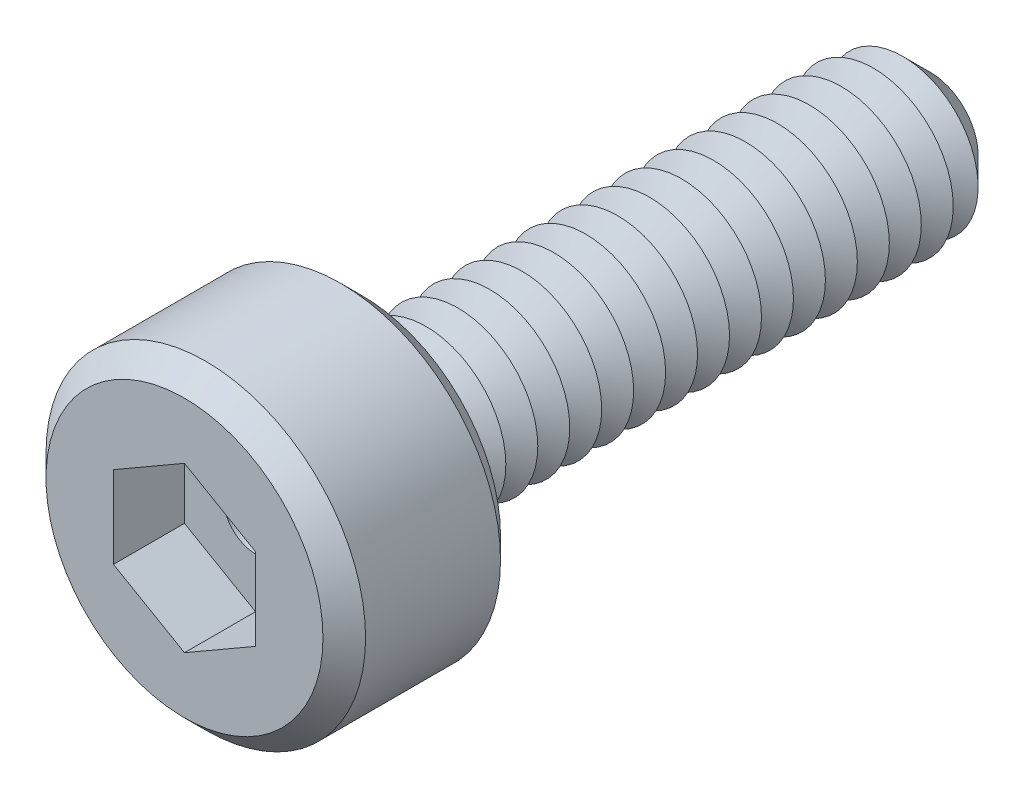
ISO-10303-21;
HEADER;
FILE_DESCRIPTION(('STEP AP214'),'2;1');
FILE_NAME('part.step','',(''),(''),'','','');
FILE_SCHEMA(('AUTOMOTIVE_DESIGN { 1 0 10303 214 1 1 1 1 }'));
ENDSEC;
DATA;
#1=APPLICATION_CONTEXT('core data for automotive mechanical design processes');
#2=APPLICATION_PROTOCOL_DEFINITION('international standard','automotive_design',2000,#1);
#3=PRODUCT_CONTEXT('',#1,'mechanical');
#4=PRODUCT('Part','Part','',(#3));
#5=PRODUCT_RELATED_PRODUCT_CATEGORY('part','',(#4));
#6=PRODUCT_DEFINITION_FORMATION('','',#4);
#7=PRODUCT_DEFINITION_CONTEXT('part definition',#1,'design');
#8=PRODUCT_DEFINITION('design','',#6,#7);
#9=PRODUCT_DEFINITION_SHAPE('','',#8);
#10=(LENGTH_UNIT() NAMED_UNIT(*) SI_UNIT(.MILLI.,.METRE.));
#11=(NAMED_UNIT(*) PLANE_ANGLE_UNIT() SI_UNIT($,.RADIAN.));
#12=(NAMED_UNIT(*) SI_UNIT($,.STERADIAN.) SOLID_ANGLE_UNIT());
#13=UNCERTAINTY_MEASURE_WITH_UNIT(LENGTH_MEASURE(1.E-05),#10,'distance_accuracy_value','');
#14=(GEOMETRIC_REPRESENTATION_CONTEXT(3) GLOBAL_UNCERTAINTY_ASSIGNED_CONTEXT((#13)) GLOBAL_UNIT_ASSIGNED_CONTEXT((#10,
#11,#12)) REPRESENTATION_CONTEXT('',''));
#15=CARTESIAN_POINT('',(0.,0.,0.));
#16=DIRECTION('',(0.,0.,1.));
#17=DIRECTION('',(1.,0.,0.));
#18=AXIS2_PLACEMENT_3D('',#15,#16,#17);
#19=CARTESIAN_POINT('',(0.,0.,2.5));
#20=DIRECTION('',(0.,0.,-1.));
#21=DIRECTION('',(-1.,0.,0.));
#22=AXIS2_PLACEMENT_3D('',#19,#20,#21);
#23=CYLINDRICAL_SURFACE('',#22,2.25);
#24=CARTESIAN_POINT('',(0.,0.,0.300000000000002));
#25=DIRECTION('',(0.,0.,1.));
#26=DIRECTION('',(1.,0.,0.));
#27=AXIS2_PLACEMENT_3D('',#24,#25,#26);
#28=CIRCLE('',#27,2.25);
#29=CARTESIAN_POINT('',(2.25,0.,0.300000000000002));
#30=VERTEX_POINT('',#29);
#31=EDGE_CURVE('E312',#30,#30,#28,.T.);
#32=ORIENTED_EDGE('',*,*,#31,.T.);
#33=EDGE_LOOP('',(#32));
#34=FACE_BOUND('',#33,.T.);
#35=CARTESIAN_POINT('',(0.,0.,2.2));
#36=DIRECTION('',(0.,0.,1.));
#37=DIRECTION('',(1.,0.,0.));
#38=AXIS2_PLACEMENT_3D('',#35,#36,#37);
#39=CIRCLE('',#38,2.25);
#40=CARTESIAN_POINT('',(2.25,0.,2.2));
#41=VERTEX_POINT('',#40);
#42=EDGE_CURVE('E305',#41,#41,#39,.F.);
#43=ORIENTED_EDGE('',*,*,#42,.T.);
#44=EDGE_LOOP('',(#43));
#45=FACE_BOUND('',#44,.T.);
#46=ADVANCED_FACE('F39',(#34,#45),#23,.T.);
#47=CARTESIAN_POINT('',(0.,0.,2.5));
#48=DIRECTION('',(0.,0.,1.));
#49=DIRECTION('',(1.,0.,0.));
#50=AXIS2_PLACEMENT_3D('',#47,#48,#49);
#51=PLANE('',#50);
#52=CARTESIAN_POINT('',(0.,0.,2.5));
#53=DIRECTION('',(0.,0.,1.));
#54=DIRECTION('',(1.,0.,0.));
#55=AXIS2_PLACEMENT_3D('',#52,#53,#54);
#56=CIRCLE('',#55,1.95);
#57=CARTESIAN_POINT('',(1.95,0.,2.5));
#58=VERTEX_POINT('',#57);
#59=EDGE_CURVE('E11',#58,#58,#56,.T.);
#60=ORIENTED_EDGE('',*,*,#59,.T.);
#61=EDGE_LOOP('',(#60));
#62=FACE_BOUND('',#61,.T.);
#63=DIRECTION('',(-0.866025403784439,0.5,0.));
#64=VECTOR('',#63,1.);
#65=CARTESIAN_POINT('',(0.999999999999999,0.577350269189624,2.5));
#66=LINE('',#65,#64);
#67=CARTESIAN_POINT('',(0.999999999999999,0.577350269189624,2.5));
#68=VERTEX_POINT('',#67);
#69=CARTESIAN_POINT('',(0.,1.15470053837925,2.5));
#70=VERTEX_POINT('',#69);
#71=EDGE_CURVE('E55',#68,#70,#66,.T.);
#72=ORIENTED_EDGE('',*,*,#71,.F.);
#73=DIRECTION('',(0.,1.,0.));
#74=VECTOR('',#73,1.);
#75=CARTESIAN_POINT('',(1.,-0.577350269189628,2.5));
#76=LINE('',#75,#74);
#77=CARTESIAN_POINT('',(1.,-0.577350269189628,2.5));
#78=VERTEX_POINT('',#77);
#79=EDGE_CURVE('E151',#78,#68,#76,.T.);
#80=ORIENTED_EDGE('',*,*,#79,.F.);
#81=DIRECTION('',(0.866025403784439,0.5,0.));
#82=VECTOR('',#81,1.);
#83=CARTESIAN_POINT('',(0.,-1.15470053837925,2.5));
#84=LINE('',#83,#82);
#85=CARTESIAN_POINT('',(0.,-1.15470053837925,2.5));
#86=VERTEX_POINT('',#85);
#87=EDGE_CURVE('E148',#86,#78,#84,.T.);
#88=ORIENTED_EDGE('',*,*,#87,.F.);
#89=DIRECTION('',(0.866025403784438,-0.5,0.));
#90=VECTOR('',#89,1.);
#91=CARTESIAN_POINT('',(-1.,-0.577350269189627,2.5));
#92=LINE('',#91,#90);
#93=CARTESIAN_POINT('',(-1.,-0.577350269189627,2.5));
#94=VERTEX_POINT('',#93);
#95=EDGE_CURVE('E103',#94,#86,#92,.T.);
#96=ORIENTED_EDGE('',*,*,#95,.F.);
#97=DIRECTION('',(0.,-1.,0.));
#98=VECTOR('',#97,1.);
#99=CARTESIAN_POINT('',(-1.,0.577350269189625,2.5));
#100=LINE('',#99,#98);
#101=CARTESIAN_POINT('',(-1.,0.577350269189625,2.5));
#102=VERTEX_POINT('',#101);
#103=EDGE_CURVE('E142',#102,#94,#100,.T.);
#104=ORIENTED_EDGE('',*,*,#103,.F.);
#105=DIRECTION('',(-0.866025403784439,-0.5,0.));
#106=VECTOR('',#105,1.);
#107=CARTESIAN_POINT('',(0.,1.15470053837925,2.5));
#108=LINE('',#107,#106);
#109=EDGE_CURVE('E137',#70,#102,#108,.T.);
#110=ORIENTED_EDGE('',*,*,#109,.F.);
#111=EDGE_LOOP('',(#72,#80,#88,#96,#104,#110));
#112=FACE_BOUND('',#111,.T.);
#113=ADVANCED_FACE('F330',(#62,#112),#51,.T.);
#114=CARTESIAN_POINT('',(0.,0.,0.));
#115=DIRECTION('',(0.,0.,1.));
#116=DIRECTION('',(1.,0.,0.));
#117=AXIS2_PLACEMENT_3D('',#114,#115,#116);
#118=PLANE('',#117);
#119=CARTESIAN_POINT('',(0.,0.,0.));
#120=DIRECTION('',(0.,0.,1.));
#121=DIRECTION('',(1.,0.,0.));
#122=AXIS2_PLACEMENT_3D('',#119,#120,#121);
#123=CIRCLE('',#122,1.95);
#124=CARTESIAN_POINT('',(1.95,0.,0.));
#125=VERTEX_POINT('',#124);
#126=EDGE_CURVE('E48',#125,#125,#123,.F.);
#127=ORIENTED_EDGE('',*,*,#126,.T.);
#128=EDGE_LOOP('',(#127));
#129=FACE_BOUND('',#128,.T.);
#130=CARTESIAN_POINT('',(0.,0.,0.));
#131=DIRECTION('',(0.,0.,1.));
#132=DIRECTION('',(1.,0.,0.));
#133=AXIS2_PLACEMENT_3D('',#130,#131,#132);
#134=CIRCLE('',#133,1.125);
#135=CARTESIAN_POINT('',(1.125,0.,0.));
#136=VERTEX_POINT('',#135);
#137=EDGE_CURVE('E297',#136,#136,#134,.T.);
#138=ORIENTED_EDGE('',*,*,#137,.T.);
#139=EDGE_LOOP('',(#138));
#140=FACE_BOUND('',#139,.T.);
#141=ADVANCED_FACE('F319',(#129,#140),#118,.F.);
#142=CARTESIAN_POINT('',(0.,0.,0.));
#143=DIRECTION('',(0.,0.,1.));
#144=DIRECTION('',(1.,0.,0.));
#145=AXIS2_PLACEMENT_3D('',#142,#143,#144);
#146=CONICAL_SURFACE('',#145,1.125,1.0471975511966);
#147=CARTESIAN_POINT('',(0.,0.,-0.225));
#148=DIRECTION('',(0.,0.,1.));
#149=DIRECTION('',(1.,0.,0.));
#150=AXIS2_PLACEMENT_3D('',#147,#148,#149);
#151=CIRCLE('',#150,0.735288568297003);
#152=CARTESIAN_POINT('',(0.735288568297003,0.,-0.225));
#153=VERTEX_POINT('',#152);
#154=EDGE_CURVE('E293',#153,#153,#151,.T.);
#155=ORIENTED_EDGE('',*,*,#154,.T.);
#156=EDGE_LOOP('',(#155));
#157=FACE_BOUND('',#156,.T.);
#158=ORIENTED_EDGE('',*,*,#137,.F.);
#159=EDGE_LOOP('',(#158));
#160=FACE_BOUND('',#159,.T.);
#161=ADVANCED_FACE('F516',(#157,#160),#146,.T.);
#162=CARTESIAN_POINT('',(0.,0.,-0.225));
#163=DIRECTION('',(0.,0.,-1.));
#164=DIRECTION('',(-1.,0.,0.));
#165=AXIS2_PLACEMENT_3D('',#162,#163,#164);
#166=CONICAL_SURFACE('',#165,0.735288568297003,1.0471975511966);
#167=CARTESIAN_POINT('',(0.,0.,-0.45));
#168=DIRECTION('',(0.,0.,1.));
#169=DIRECTION('',(1.,0.,0.));
#170=AXIS2_PLACEMENT_3D('',#167,#168,#169);
#171=CIRCLE('',#170,1.125);
#172=CARTESIAN_POINT('',(1.125,0.,-0.45));
#173=VERTEX_POINT('',#172);
#174=EDGE_CURVE('E289',#173,#173,#171,.T.);
#175=ORIENTED_EDGE('',*,*,#174,.T.);
#176=EDGE_LOOP('',(#175));
#177=FACE_BOUND('',#176,.T.);
#178=ORIENTED_EDGE('',*,*,#154,.F.);
#179=EDGE_LOOP('',(#178));
#180=FACE_BOUND('',#179,.T.);
#181=ADVANCED_FACE('F512',(#177,#180),#166,.T.);
#182=CARTESIAN_POINT('',(0.,0.,-0.45));
#183=DIRECTION('',(0.,0.,1.));
#184=DIRECTION('',(1.,0.,0.));
#185=AXIS2_PLACEMENT_3D('',#182,#183,#184);
#186=CONICAL_SURFACE('',#185,1.125,1.0471975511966);
#187=CARTESIAN_POINT('',(0.,0.,-0.675));
#188=DIRECTION('',(0.,0.,1.));
#189=DIRECTION('',(1.,0.,0.));
#190=AXIS2_PLACEMENT_3D('',#187,#188,#189);
#191=CIRCLE('',#190,0.735288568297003);
#192=CARTESIAN_POINT('',(0.735288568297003,0.,-0.675));
#193=VERTEX_POINT('',#192);
#194=EDGE_CURVE('E285',#193,#193,#191,.T.);
#195=ORIENTED_EDGE('',*,*,#194,.T.);
#196=EDGE_LOOP('',(#195));
#197=FACE_BOUND('',#196,.T.);
#198=ORIENTED_EDGE('',*,*,#174,.F.);
#199=EDGE_LOOP('',(#198));
#200=FACE_BOUND('',#199,.T.);
#201=ADVANCED_FACE('F508',(#197,#200),#186,.T.);
#202=CARTESIAN_POINT('',(0.,0.,-0.675));
#203=DIRECTION('',(0.,0.,-1.));
#204=DIRECTION('',(-1.,0.,0.));
#205=AXIS2_PLACEMENT_3D('',#202,#203,#204);
#206=CONICAL_SURFACE('',#205,0.735288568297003,1.0471975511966);
#207=CARTESIAN_POINT('',(0.,0.,-0.9));
#208=DIRECTION('',(0.,0.,1.));
#209=DIRECTION('',(1.,0.,0.));
#210=AXIS2_PLACEMENT_3D('',#207,#208,#209);
#211=CIRCLE('',#210,1.125);
#212=CARTESIAN_POINT('',(1.125,0.,-0.9));
#213=VERTEX_POINT('',#212);
#214=EDGE_CURVE('E281',#213,#213,#211,.T.);
#215=ORIENTED_EDGE('',*,*,#214,.T.);
#216=EDGE_LOOP('',(#215));
#217=FACE_BOUND('',#216,.T.);
#218=ORIENTED_EDGE('',*,*,#194,.F.);
#219=EDGE_LOOP('',(#218));
#220=FACE_BOUND('',#219,.T.);
#221=ADVANCED_FACE('F504',(#217,#220),#206,.T.);
#222=CARTESIAN_POINT('',(0.,0.,-0.9));
#223=DIRECTION('',(0.,0.,1.));
#224=DIRECTION('',(1.,0.,0.));
#225=AXIS2_PLACEMENT_3D('',#222,#223,#224);
#226=CONICAL_SURFACE('',#225,1.125,1.0471975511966);
#227=CARTESIAN_POINT('',(0.,0.,-1.125));
#228=DIRECTION('',(0.,0.,1.));
#229=DIRECTION('',(1.,0.,0.));
#230=AXIS2_PLACEMENT_3D('',#227,#228,#229);
#231=CIRCLE('',#230,0.735288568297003);
#232=CARTESIAN_POINT('',(0.735288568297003,0.,-1.125));
#233=VERTEX_POINT('',#232);
#234=EDGE_CURVE('E277',#233,#233,#231,.T.);
#235=ORIENTED_EDGE('',*,*,#234,.T.);
#236=EDGE_LOOP('',(#235));
#237=FACE_BOUND('',#236,.T.);
#238=ORIENTED_EDGE('',*,*,#214,.F.);
#239=EDGE_LOOP('',(#238));
#240=FACE_BOUND('',#239,.T.);
#241=ADVANCED_FACE('F500',(#237,#240),#226,.T.);
#242=CARTESIAN_POINT('',(0.,0.,-1.125));
#243=DIRECTION('',(0.,0.,-1.));
#244=DIRECTION('',(-1.,0.,0.));
#245=AXIS2_PLACEMENT_3D('',#242,#243,#244);
#246=CONICAL_SURFACE('',#245,0.735288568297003,1.0471975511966);
#247=CARTESIAN_POINT('',(0.,0.,-1.35));
#248=DIRECTION('',(0.,0.,1.));
#249=DIRECTION('',(1.,0.,0.));
#250=AXIS2_PLACEMENT_3D('',#247,#248,#249);
#251=CIRCLE('',#250,1.125);
#252=CARTESIAN_POINT('',(1.125,0.,-1.35));
#253=VERTEX_POINT('',#252);
#254=EDGE_CURVE('E273',#253,#253,#251,.T.);
#255=ORIENTED_EDGE('',*,*,#254,.T.);
#256=EDGE_LOOP('',(#255));
#257=FACE_BOUND('',#256,.T.);
#258=ORIENTED_EDGE('',*,*,#234,.F.);
#259=EDGE_LOOP('',(#258));
#260=FACE_BOUND('',#259,.T.);
#261=ADVANCED_FACE('F496',(#257,#260),#246,.T.);
#262=CARTESIAN_POINT('',(0.,0.,-1.35));
#263=DIRECTION('',(0.,0.,1.));
#264=DIRECTION('',(1.,0.,0.));
#265=AXIS2_PLACEMENT_3D('',#262,#263,#264);
#266=CONICAL_SURFACE('',#265,1.125,1.0471975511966);
#267=CARTESIAN_POINT('',(0.,0.,-1.575));
#268=DIRECTION('',(0.,0.,1.));
#269=DIRECTION('',(1.,0.,0.));
#270=AXIS2_PLACEMENT_3D('',#267,#268,#269);
#271=CIRCLE('',#270,0.735288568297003);
#272=CARTESIAN_POINT('',(0.735288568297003,0.,-1.575));
#273=VERTEX_POINT('',#272);
#274=EDGE_CURVE('E269',#273,#273,#271,.T.);
#275=ORIENTED_EDGE('',*,*,#274,.T.);
#276=EDGE_LOOP('',(#275));
#277=FACE_BOUND('',#276,.T.);
#278=ORIENTED_EDGE('',*,*,#254,.F.);
#279=EDGE_LOOP('',(#278));
#280=FACE_BOUND('',#279,.T.);
#281=ADVANCED_FACE('F492',(#277,#280),#266,.T.);
#282=CARTESIAN_POINT('',(0.,0.,-1.575));
#283=DIRECTION('',(0.,0.,-1.));
#284=DIRECTION('',(-1.,0.,0.));
#285=AXIS2_PLACEMENT_3D('',#282,#283,#284);
#286=CONICAL_SURFACE('',#285,0.735288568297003,1.0471975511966);
#287=CARTESIAN_POINT('',(0.,0.,-1.8));
#288=DIRECTION('',(0.,0.,1.));
#289=DIRECTION('',(1.,0.,0.));
#290=AXIS2_PLACEMENT_3D('',#287,#288,#289);
#291=CIRCLE('',#290,1.125);
#292=CARTESIAN_POINT('',(1.125,0.,-1.8));
#293=VERTEX_POINT('',#292);
#294=EDGE_CURVE('E265',#293,#293,#291,.T.);
#295=ORIENTED_EDGE('',*,*,#294,.T.);
#296=EDGE_LOOP('',(#295));
#297=FACE_BOUND('',#296,.T.);
#298=ORIENTED_EDGE('',*,*,#274,.F.);
#299=EDGE_LOOP('',(#298));
#300=FACE_BOUND('',#299,.T.);
#301=ADVANCED_FACE('F488',(#297,#300),#286,.T.);
#302=CARTESIAN_POINT('',(0.,0.,-1.8));
#303=DIRECTION('',(0.,0.,1.));
#304=DIRECTION('',(1.,0.,0.));
#305=AXIS2_PLACEMENT_3D('',#302,#303,#304);
#306=CONICAL_SURFACE('',#305,1.125,1.0471975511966);
#307=CARTESIAN_POINT('',(0.,0.,-2.025));
#308=DIRECTION('',(0.,0.,1.));
#309=DIRECTION('',(1.,0.,0.));
#310=AXIS2_PLACEMENT_3D('',#307,#308,#309);
#311=CIRCLE('',#310,0.735288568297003);
#312=CARTESIAN_POINT('',(0.735288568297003,0.,-2.025));
#313=VERTEX_POINT('',#312);
#314=EDGE_CURVE('E261',#313,#313,#311,.T.);
#315=ORIENTED_EDGE('',*,*,#314,.T.);
#316=EDGE_LOOP('',(#315));
#317=FACE_BOUND('',#316,.T.);
#318=ORIENTED_EDGE('',*,*,#294,.F.);
#319=EDGE_LOOP('',(#318));
#320=FACE_BOUND('',#319,.T.);
#321=ADVANCED_FACE('F484',(#317,#320),#306,.T.);
#322=CARTESIAN_POINT('',(0.,0.,-2.025));
#323=DIRECTION('',(0.,0.,-1.));
#324=DIRECTION('',(-1.,0.,0.));
#325=AXIS2_PLACEMENT_3D('',#322,#323,#324);
#326=CONICAL_SURFACE('',#325,0.735288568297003,1.0471975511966);
#327=CARTESIAN_POINT('',(0.,0.,-2.25));
#328=DIRECTION('',(0.,0.,1.));
#329=DIRECTION('',(1.,0.,0.));
#330=AXIS2_PLACEMENT_3D('',#327,#328,#329);
#331=CIRCLE('',#330,1.125);
#332=CARTESIAN_POINT('',(1.125,0.,-2.25));
#333=VERTEX_POINT('',#332);
#334=EDGE_CURVE('E257',#333,#333,#331,.T.);
#335=ORIENTED_EDGE('',*,*,#334,.T.);
#336=EDGE_LOOP('',(#335));
#337=FACE_BOUND('',#336,.T.);
#338=ORIENTED_EDGE('',*,*,#314,.F.);
#339=EDGE_LOOP('',(#338));
#340=FACE_BOUND('',#339,.T.);
#341=ADVANCED_FACE('F480',(#337,#340),#326,.T.);
#342=CARTESIAN_POINT('',(0.,0.,-2.25));
#343=DIRECTION('',(0.,0.,1.));
#344=DIRECTION('',(1.,0.,0.));
#345=AXIS2_PLACEMENT_3D('',#342,#343,#344);
#346=CONICAL_SURFACE('',#345,1.125,1.0471975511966);
#347=CARTESIAN_POINT('',(0.,0.,-2.475));
#348=DIRECTION('',(0.,0.,1.));
#349=DIRECTION('',(1.,0.,0.));
#350=AXIS2_PLACEMENT_3D('',#347,#348,#349);
#351=CIRCLE('',#350,0.735288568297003);
#352=CARTESIAN_POINT('',(0.735288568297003,0.,-2.475));
#353=VERTEX_POINT('',#352);
#354=EDGE_CURVE('E253',#353,#353,#351,.T.);
#355=ORIENTED_EDGE('',*,*,#354,.T.);
#356=EDGE_LOOP('',(#355));
#357=FACE_BOUND('',#356,.T.);
#358=ORIENTED_EDGE('',*,*,#334,.F.);
#359=EDGE_LOOP('',(#358));
#360=FACE_BOUND('',#359,.T.);
#361=ADVANCED_FACE('F476',(#357,#360),#346,.T.);
#362=CARTESIAN_POINT('',(0.,0.,-2.475));
#363=DIRECTION('',(0.,0.,-1.));
#364=DIRECTION('',(-1.,0.,0.));
#365=AXIS2_PLACEMENT_3D('',#362,#363,#364);
#366=CONICAL_SURFACE('',#365,0.735288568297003,1.0471975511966);
#367=CARTESIAN_POINT('',(0.,0.,-2.7));
#368=DIRECTION('',(0.,0.,1.));
#369=DIRECTION('',(1.,0.,0.));
#370=AXIS2_PLACEMENT_3D('',#367,#368,#369);
#371=CIRCLE('',#370,1.125);
#372=CARTESIAN_POINT('',(1.125,0.,-2.7));
#373=VERTEX_POINT('',#372);
#374=EDGE_CURVE('E250',#373,#373,#371,.T.);
#375=ORIENTED_EDGE('',*,*,#374,.T.);
#376=EDGE_LOOP('',(#375));
#377=FACE_BOUND('',#376,.T.);
#378=ORIENTED_EDGE('',*,*,#354,.F.);
#379=EDGE_LOOP('',(#378));
#380=FACE_BOUND('',#379,.T.);
#381=ADVANCED_FACE('F472',(#377,#380),#366,.T.);
#382=CARTESIAN_POINT('',(0.,0.,-2.7));
#383=DIRECTION('',(0.,0.,1.));
#384=DIRECTION('',(1.,0.,0.));
#385=AXIS2_PLACEMENT_3D('',#382,#383,#384);
#386=CONICAL_SURFACE('',#385,1.125,1.0471975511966);
#387=CARTESIAN_POINT('',(0.,0.,-2.925));
#388=DIRECTION('',(0.,0.,1.));
#389=DIRECTION('',(1.,0.,0.));
#390=AXIS2_PLACEMENT_3D('',#387,#388,#389);
#391=CIRCLE('',#390,0.735288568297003);
#392=CARTESIAN_POINT('',(0.735288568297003,0.,-2.925));
#393=VERTEX_POINT('',#392);
#394=EDGE_CURVE('E246',#393,#393,#391,.T.);
#395=ORIENTED_EDGE('',*,*,#394,.T.);
#396=EDGE_LOOP('',(#395));
#397=FACE_BOUND('',#396,.T.);
#398=ORIENTED_EDGE('',*,*,#374,.F.);
#399=EDGE_LOOP('',(#398));
#400=FACE_BOUND('',#399,.T.);
#401=ADVANCED_FACE('F468',(#397,#400),#386,.T.);
#402=CARTESIAN_POINT('',(0.,0.,-2.925));
#403=DIRECTION('',(0.,0.,-1.));
#404=DIRECTION('',(-1.,0.,0.));
#405=AXIS2_PLACEMENT_3D('',#402,#403,#404);
#406=CONICAL_SURFACE('',#405,0.735288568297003,1.0471975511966);
#407=CARTESIAN_POINT('',(0.,0.,-3.15));
#408=DIRECTION('',(0.,0.,1.));
#409=DIRECTION('',(1.,0.,0.));
#410=AXIS2_PLACEMENT_3D('',#407,#408,#409);
#411=CIRCLE('',#410,1.125);
#412=CARTESIAN_POINT('',(1.125,0.,-3.15));
#413=VERTEX_POINT('',#412);
#414=EDGE_CURVE('E242',#413,#413,#411,.T.);
#415=ORIENTED_EDGE('',*,*,#414,.T.);
#416=EDGE_LOOP('',(#415));
#417=FACE_BOUND('',#416,.T.);
#418=ORIENTED_EDGE('',*,*,#394,.F.);
#419=EDGE_LOOP('',(#418));
#420=FACE_BOUND('',#419,.T.);
#421=ADVANCED_FACE('F464',(#417,#420),#406,.T.);
#422=CARTESIAN_POINT('',(0.,0.,-3.15));
#423=DIRECTION('',(0.,0.,1.));
#424=DIRECTION('',(1.,0.,0.));
#425=AXIS2_PLACEMENT_3D('',#422,#423,#424);
#426=CONICAL_SURFACE('',#425,1.125,1.0471975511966);
#427=CARTESIAN_POINT('',(0.,0.,-3.375));
#428=DIRECTION('',(0.,0.,1.));
#429=DIRECTION('',(1.,0.,0.));
#430=AXIS2_PLACEMENT_3D('',#427,#428,#429);
#431=CIRCLE('',#430,0.735288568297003);
#432=CARTESIAN_POINT('',(0.735288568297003,0.,-3.375));
#433=VERTEX_POINT('',#432);
#434=EDGE_CURVE('E238',#433,#433,#431,.T.);
#435=ORIENTED_EDGE('',*,*,#434,.T.);
#436=EDGE_LOOP('',(#435));
#437=FACE_BOUND('',#436,.T.);
#438=ORIENTED_EDGE('',*,*,#414,.F.);
#439=EDGE_LOOP('',(#438));
#440=FACE_BOUND('',#439,.T.);
#441=ADVANCED_FACE('F460',(#437,#440),#426,.T.);
#442=CARTESIAN_POINT('',(0.,0.,-3.375));
#443=DIRECTION('',(0.,0.,-1.));
#444=DIRECTION('',(-1.,0.,0.));
#445=AXIS2_PLACEMENT_3D('',#442,#443,#444);
#446=CONICAL_SURFACE('',#445,0.735288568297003,1.0471975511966);
#447=CARTESIAN_POINT('',(0.,0.,-3.6));
#448=DIRECTION('',(0.,0.,1.));
#449=DIRECTION('',(1.,0.,0.));
#450=AXIS2_PLACEMENT_3D('',#447,#448,#449);
#451=CIRCLE('',#450,1.125);
#452=CARTESIAN_POINT('',(1.125,0.,-3.6));
#453=VERTEX_POINT('',#452);
#454=EDGE_CURVE('E234',#453,#453,#451,.T.);
#455=ORIENTED_EDGE('',*,*,#454,.T.);
#456=EDGE_LOOP('',(#455));
#457=FACE_BOUND('',#456,.T.);
#458=ORIENTED_EDGE('',*,*,#434,.F.);
#459=EDGE_LOOP('',(#458));
#460=FACE_BOUND('',#459,.T.);
#461=ADVANCED_FACE('F456',(#457,#460),#446,.T.);
#462=CARTESIAN_POINT('',(0.,0.,-3.6));
#463=DIRECTION('',(0.,0.,1.));
#464=DIRECTION('',(1.,0.,0.));
#465=AXIS2_PLACEMENT_3D('',#462,#463,#464);
#466=CONICAL_SURFACE('',#465,1.125,1.0471975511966);
#467=CARTESIAN_POINT('',(0.,0.,-3.825));
#468=DIRECTION('',(0.,0.,1.));
#469=DIRECTION('',(1.,0.,0.));
#470=AXIS2_PLACEMENT_3D('',#467,#468,#469);
#471=CIRCLE('',#470,0.735288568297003);
#472=CARTESIAN_POINT('',(0.735288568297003,0.,-3.825));
#473=VERTEX_POINT('',#472);
#474=EDGE_CURVE('E230',#473,#473,#471,.T.);
#475=ORIENTED_EDGE('',*,*,#474,.T.);
#476=EDGE_LOOP('',(#475));
#477=FACE_BOUND('',#476,.T.);
#478=ORIENTED_EDGE('',*,*,#454,.F.);
#479=EDGE_LOOP('',(#478));
#480=FACE_BOUND('',#479,.T.);
#481=ADVANCED_FACE('F452',(#477,#480),#466,.T.);
#482=CARTESIAN_POINT('',(0.,0.,-3.825));
#483=DIRECTION('',(0.,0.,-1.));
#484=DIRECTION('',(-1.,0.,0.));
#485=AXIS2_PLACEMENT_3D('',#482,#483,#484);
#486=CONICAL_SURFACE('',#485,0.735288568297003,1.0471975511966);
#487=CARTESIAN_POINT('',(0.,0.,-4.05));
#488=DIRECTION('',(0.,0.,1.));
#489=DIRECTION('',(1.,0.,0.));
#490=AXIS2_PLACEMENT_3D('',#487,#488,#489);
#491=CIRCLE('',#490,1.125);
#492=CARTESIAN_POINT('',(1.125,0.,-4.05));
#493=VERTEX_POINT('',#492);
#494=EDGE_CURVE('E226',#493,#493,#491,.T.);
#495=ORIENTED_EDGE('',*,*,#494,.T.);
#496=EDGE_LOOP('',(#495));
#497=FACE_BOUND('',#496,.T.);
#498=ORIENTED_EDGE('',*,*,#474,.F.);
#499=EDGE_LOOP('',(#498));
#500=FACE_BOUND('',#499,.T.);
#501=ADVANCED_FACE('F448',(#497,#500),#486,.T.);
#502=CARTESIAN_POINT('',(0.,0.,-4.05));
#503=DIRECTION('',(0.,0.,1.));
#504=DIRECTION('',(1.,0.,0.));
#505=AXIS2_PLACEMENT_3D('',#502,#503,#504);
#506=CONICAL_SURFACE('',#505,1.125,1.0471975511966);
#507=CARTESIAN_POINT('',(0.,0.,-4.275));
#508=DIRECTION('',(0.,0.,1.));
#509=DIRECTION('',(1.,0.,0.));
#510=AXIS2_PLACEMENT_3D('',#507,#508,#509);
#511=CIRCLE('',#510,0.735288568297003);
#512=CARTESIAN_POINT('',(0.735288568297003,0.,-4.275));
#513=VERTEX_POINT('',#512);
#514=EDGE_CURVE('E222',#513,#513,#511,.T.);
#515=ORIENTED_EDGE('',*,*,#514,.T.);
#516=EDGE_LOOP('',(#515));
#517=FACE_BOUND('',#516,.T.);
#518=ORIENTED_EDGE('',*,*,#494,.F.);
#519=EDGE_LOOP('',(#518));
#520=FACE_BOUND('',#519,.T.);
#521=ADVANCED_FACE('F444',(#517,#520),#506,.T.);
#522=CARTESIAN_POINT('',(0.,0.,-4.275));
#523=DIRECTION('',(0.,0.,-1.));
#524=DIRECTION('',(-1.,0.,0.));
#525=AXIS2_PLACEMENT_3D('',#522,#523,#524);
#526=CONICAL_SURFACE('',#525,0.735288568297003,1.0471975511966);
#527=CARTESIAN_POINT('',(0.,0.,-4.5));
#528=DIRECTION('',(0.,0.,1.));
#529=DIRECTION('',(1.,0.,0.));
#530=AXIS2_PLACEMENT_3D('',#527,#528,#529);
#531=CIRCLE('',#530,1.125);
#532=CARTESIAN_POINT('',(1.125,0.,-4.5));
#533=VERTEX_POINT('',#532);
#534=EDGE_CURVE('E218',#533,#533,#531,.T.);
#535=ORIENTED_EDGE('',*,*,#534,.T.);
#536=EDGE_LOOP('',(#535));
#537=FACE_BOUND('',#536,.T.);
#538=ORIENTED_EDGE('',*,*,#514,.F.);
#539=EDGE_LOOP('',(#538));
#540=FACE_BOUND('',#539,.T.);
#541=ADVANCED_FACE('F440',(#537,#540),#526,.T.);
#542=CARTESIAN_POINT('',(0.,0.,-4.5));
#543=DIRECTION('',(0.,0.,1.));
#544=DIRECTION('',(1.,0.,0.));
#545=AXIS2_PLACEMENT_3D('',#542,#543,#544);
#546=CONICAL_SURFACE('',#545,1.125,1.0471975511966);
#547=CARTESIAN_POINT('',(0.,0.,-4.725));
#548=DIRECTION('',(0.,0.,1.));
#549=DIRECTION('',(1.,0.,0.));
#550=AXIS2_PLACEMENT_3D('',#547,#548,#549);
#551=CIRCLE('',#550,0.735288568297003);
#552=CARTESIAN_POINT('',(0.735288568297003,0.,-4.725));
#553=VERTEX_POINT('',#552);
#554=EDGE_CURVE('E214',#553,#553,#551,.T.);
#555=ORIENTED_EDGE('',*,*,#554,.T.);
#556=EDGE_LOOP('',(#555));
#557=FACE_BOUND('',#556,.T.);
#558=ORIENTED_EDGE('',*,*,#534,.F.);
#559=EDGE_LOOP('',(#558));
#560=FACE_BOUND('',#559,.T.);
#561=ADVANCED_FACE('F436',(#557,#560),#546,.T.);
#562=CARTESIAN_POINT('',(0.,0.,-4.725));
#563=DIRECTION('',(0.,0.,-1.));
#564=DIRECTION('',(-1.,0.,0.));
#565=AXIS2_PLACEMENT_3D('',#562,#563,#564);
#566=CONICAL_SURFACE('',#565,0.735288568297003,1.0471975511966);
#567=CARTESIAN_POINT('',(0.,0.,-4.95));
#568=DIRECTION('',(0.,0.,1.));
#569=DIRECTION('',(1.,0.,0.));
#570=AXIS2_PLACEMENT_3D('',#567,#568,#569);
#571=CIRCLE('',#570,1.125);
#572=CARTESIAN_POINT('',(1.125,0.,-4.95));
#573=VERTEX_POINT('',#572);
#574=EDGE_CURVE('E210',#573,#573,#571,.T.);
#575=ORIENTED_EDGE('',*,*,#574,.T.);
#576=EDGE_LOOP('',(#575));
#577=FACE_BOUND('',#576,.T.);
#578=ORIENTED_EDGE('',*,*,#554,.F.);
#579=EDGE_LOOP('',(#578));
#580=FACE_BOUND('',#579,.T.);
#581=ADVANCED_FACE('F432',(#577,#580),#566,.T.);
#582=CARTESIAN_POINT('',(0.,0.,-4.95));
#583=DIRECTION('',(0.,0.,1.));
#584=DIRECTION('',(1.,0.,0.));
#585=AXIS2_PLACEMENT_3D('',#582,#583,#584);
#586=CONICAL_SURFACE('',#585,1.125,1.0471975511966);
#587=CARTESIAN_POINT('',(0.,0.,-5.175));
#588=DIRECTION('',(0.,0.,1.));
#589=DIRECTION('',(1.,0.,0.));
#590=AXIS2_PLACEMENT_3D('',#587,#588,#589);
#591=CIRCLE('',#590,0.735288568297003);
#592=CARTESIAN_POINT('',(0.735288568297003,0.,-5.175));
#593=VERTEX_POINT('',#592);
#594=EDGE_CURVE('E206',#593,#593,#591,.T.);
#595=ORIENTED_EDGE('',*,*,#594,.T.);
#596=EDGE_LOOP('',(#595));
#597=FACE_BOUND('',#596,.T.);
#598=ORIENTED_EDGE('',*,*,#574,.F.);
#599=EDGE_LOOP('',(#598));
#600=FACE_BOUND('',#599,.T.);
#601=ADVANCED_FACE('F428',(#597,#600),#586,.T.);
#602=CARTESIAN_POINT('',(0.,0.,-5.175));
#603=DIRECTION('',(0.,0.,-1.));
#604=DIRECTION('',(-1.,0.,0.));
#605=AXIS2_PLACEMENT_3D('',#602,#603,#604);
#606=CONICAL_SURFACE('',#605,0.735288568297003,1.0471975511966);
#607=CARTESIAN_POINT('',(0.,0.,-5.4));
#608=DIRECTION('',(0.,0.,1.));
#609=DIRECTION('',(1.,0.,0.));
#610=AXIS2_PLACEMENT_3D('',#607,#608,#609);
#611=CIRCLE('',#610,1.125);
#612=CARTESIAN_POINT('',(1.125,0.,-5.4));
#613=VERTEX_POINT('',#612);
#614=EDGE_CURVE('E202',#613,#613,#611,.T.);
#615=ORIENTED_EDGE('',*,*,#614,.T.);
#616=EDGE_LOOP('',(#615));
#617=FACE_BOUND('',#616,.T.);
#618=ORIENTED_EDGE('',*,*,#594,.F.);
#619=EDGE_LOOP('',(#618));
#620=FACE_BOUND('',#619,.T.);
#621=ADVANCED_FACE('F424',(#617,#620),#606,.T.);
#622=CARTESIAN_POINT('',(0.,0.,-5.4));
#623=DIRECTION('',(0.,0.,1.));
#624=DIRECTION('',(1.,0.,0.));
#625=AXIS2_PLACEMENT_3D('',#622,#623,#624);
#626=CONICAL_SURFACE('',#625,1.125,1.0471975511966);
#627=CARTESIAN_POINT('',(0.,0.,-5.625));
#628=DIRECTION('',(0.,0.,1.));
#629=DIRECTION('',(1.,0.,0.));
#630=AXIS2_PLACEMENT_3D('',#627,#628,#629);
#631=CIRCLE('',#630,0.735288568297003);
#632=CARTESIAN_POINT('',(0.735288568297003,0.,-5.625));
#633=VERTEX_POINT('',#632);
#634=EDGE_CURVE('E198',#633,#633,#631,.T.);
#635=ORIENTED_EDGE('',*,*,#634,.T.);
#636=EDGE_LOOP('',(#635));
#637=FACE_BOUND('',#636,.T.);
#638=ORIENTED_EDGE('',*,*,#614,.F.);
#639=EDGE_LOOP('',(#638));
#640=FACE_BOUND('',#639,.T.);
#641=ADVANCED_FACE('F420',(#637,#640),#626,.T.);
#642=CARTESIAN_POINT('',(0.,0.,-5.625));
#643=DIRECTION('',(0.,0.,-1.));
#644=DIRECTION('',(-1.,0.,0.));
#645=AXIS2_PLACEMENT_3D('',#642,#643,#644);
#646=CONICAL_SURFACE('',#645,0.735288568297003,1.0471975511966);
#647=CARTESIAN_POINT('',(0.,0.,-5.85));
#648=DIRECTION('',(0.,0.,1.));
#649=DIRECTION('',(1.,0.,0.));
#650=AXIS2_PLACEMENT_3D('',#647,#648,#649);
#651=CIRCLE('',#650,1.125);
#652=CARTESIAN_POINT('',(1.125,0.,-5.85));
#653=VERTEX_POINT('',#652);
#654=EDGE_CURVE('E194',#653,#653,#651,.T.);
#655=ORIENTED_EDGE('',*,*,#654,.T.);
#656=EDGE_LOOP('',(#655));
#657=FACE_BOUND('',#656,.T.);
#658=ORIENTED_EDGE('',*,*,#634,.F.);
#659=EDGE_LOOP('',(#658));
#660=FACE_BOUND('',#659,.T.);
#661=ADVANCED_FACE('F416',(#657,#660),#646,.T.);
#662=CARTESIAN_POINT('',(0.,0.,-5.85));
#663=DIRECTION('',(0.,0.,1.));
#664=DIRECTION('',(1.,0.,0.));
#665=AXIS2_PLACEMENT_3D('',#662,#663,#664);
#666=CONICAL_SURFACE('',#665,1.125,1.0471975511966);
#667=CARTESIAN_POINT('',(0.,0.,-6.075));
#668=DIRECTION('',(0.,0.,1.));
#669=DIRECTION('',(1.,0.,0.));
#670=AXIS2_PLACEMENT_3D('',#667,#668,#669);
#671=CIRCLE('',#670,0.735288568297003);
#672=CARTESIAN_POINT('',(0.735288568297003,0.,-6.075));
#673=VERTEX_POINT('',#672);
#674=EDGE_CURVE('E190',#673,#673,#671,.T.);
#675=ORIENTED_EDGE('',*,*,#674,.T.);
#676=EDGE_LOOP('',(#675));
#677=FACE_BOUND('',#676,.T.);
#678=ORIENTED_EDGE('',*,*,#654,.F.);
#679=EDGE_LOOP('',(#678));
#680=FACE_BOUND('',#679,.T.);
#681=ADVANCED_FACE('F412',(#677,#680),#666,.T.);
#682=CARTESIAN_POINT('',(0.,0.,-6.075));
#683=DIRECTION('',(0.,0.,-1.));
#684=DIRECTION('',(-1.,0.,0.));
#685=AXIS2_PLACEMENT_3D('',#682,#683,#684);
#686=CONICAL_SURFACE('',#685,0.735288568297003,1.0471975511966);
#687=CARTESIAN_POINT('',(0.,0.,-6.3));
#688=DIRECTION('',(0.,0.,1.));
#689=DIRECTION('',(1.,0.,0.));
#690=AXIS2_PLACEMENT_3D('',#687,#688,#689);
#691=CIRCLE('',#690,1.125);
#692=CARTESIAN_POINT('',(1.125,0.,-6.3));
#693=VERTEX_POINT('',#692);
#694=EDGE_CURVE('E186',#693,#693,#691,.T.);
#695=ORIENTED_EDGE('',*,*,#694,.T.);
#696=EDGE_LOOP('',(#695));
#697=FACE_BOUND('',#696,.T.);
#698=ORIENTED_EDGE('',*,*,#674,.F.);
#699=EDGE_LOOP('',(#698));
#700=FACE_BOUND('',#699,.T.);
#701=ADVANCED_FACE('F408',(#697,#700),#686,.T.);
#702=CARTESIAN_POINT('',(0.,0.,-6.3));
#703=DIRECTION('',(0.,0.,1.));
#704=DIRECTION('',(1.,0.,0.));
#705=AXIS2_PLACEMENT_3D('',#702,#703,#704);
#706=CONICAL_SURFACE('',#705,1.125,1.0471975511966);
#707=CARTESIAN_POINT('',(0.,0.,-6.525));
#708=DIRECTION('',(0.,0.,1.));
#709=DIRECTION('',(1.,0.,0.));
#710=AXIS2_PLACEMENT_3D('',#707,#708,#709);
#711=CIRCLE('',#710,0.735288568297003);
#712=CARTESIAN_POINT('',(0.735288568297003,0.,-6.525));
#713=VERTEX_POINT('',#712);
#714=EDGE_CURVE('E183',#713,#713,#711,.T.);
#715=ORIENTED_EDGE('',*,*,#714,.T.);
#716=EDGE_LOOP('',(#715));
#717=FACE_BOUND('',#716,.T.);
#718=ORIENTED_EDGE('',*,*,#694,.F.);
#719=EDGE_LOOP('',(#718));
#720=FACE_BOUND('',#719,.T.);
#721=ADVANCED_FACE('F404',(#717,#720),#706,.T.);
#722=CARTESIAN_POINT('',(0.,0.,-6.525));
#723=DIRECTION('',(0.,0.,-1.));
#724=DIRECTION('',(-1.,0.,0.));
#725=AXIS2_PLACEMENT_3D('',#722,#723,#724);
#726=CONICAL_SURFACE('',#725,0.735288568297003,1.0471975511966);
#727=CARTESIAN_POINT('',(0.,0.,-6.75));
#728=DIRECTION('',(0.,0.,1.));
#729=DIRECTION('',(1.,0.,0.));
#730=AXIS2_PLACEMENT_3D('',#727,#728,#729);
#731=CIRCLE('',#730,1.125);
#732=CARTESIAN_POINT('',(1.125,0.,-6.75));
#733=VERTEX_POINT('',#732);
#734=EDGE_CURVE('E179',#733,#733,#731,.T.);
#735=ORIENTED_EDGE('',*,*,#734,.T.);
#736=EDGE_LOOP('',(#735));
#737=FACE_BOUND('',#736,.T.);
#738=ORIENTED_EDGE('',*,*,#714,.F.);
#739=EDGE_LOOP('',(#738));
#740=FACE_BOUND('',#739,.T.);
#741=ADVANCED_FACE('F400',(#737,#740),#726,.T.);
#742=CARTESIAN_POINT('',(0.,0.,-6.75));
#743=DIRECTION('',(0.,0.,1.));
#744=DIRECTION('',(1.,0.,0.));
#745=AXIS2_PLACEMENT_3D('',#742,#743,#744);
#746=CONICAL_SURFACE('',#745,1.125,1.0471975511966);
#747=CARTESIAN_POINT('',(0.,0.,-6.975));
#748=DIRECTION('',(0.,0.,1.));
#749=DIRECTION('',(1.,0.,0.));
#750=AXIS2_PLACEMENT_3D('',#747,#748,#749);
#751=CIRCLE('',#750,0.735288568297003);
#752=CARTESIAN_POINT('',(0.735288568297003,0.,-6.975));
#753=VERTEX_POINT('',#752);
#754=EDGE_CURVE('E175',#753,#753,#751,.T.);
#755=ORIENTED_EDGE('',*,*,#754,.T.);
#756=EDGE_LOOP('',(#755));
#757=FACE_BOUND('',#756,.T.);
#758=ORIENTED_EDGE('',*,*,#734,.F.);
#759=EDGE_LOOP('',(#758));
#760=FACE_BOUND('',#759,.T.);
#761=ADVANCED_FACE('F396',(#757,#760),#746,.T.);
#762=CARTESIAN_POINT('',(0.,0.,-6.975));
#763=DIRECTION('',(0.,0.,-1.));
#764=DIRECTION('',(-1.,0.,0.));
#765=AXIS2_PLACEMENT_3D('',#762,#763,#764);
#766=CONICAL_SURFACE('',#765,0.735288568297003,1.0471975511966);
#767=CARTESIAN_POINT('',(0.,0.,-7.2));
#768=DIRECTION('',(0.,0.,1.));
#769=DIRECTION('',(1.,0.,0.));
#770=AXIS2_PLACEMENT_3D('',#767,#768,#769);
#771=CIRCLE('',#770,1.125);
#772=CARTESIAN_POINT('',(1.125,0.,-7.2));
#773=VERTEX_POINT('',#772);
#774=EDGE_CURVE('E170',#773,#773,#771,.T.);
#775=ORIENTED_EDGE('',*,*,#774,.T.);
#776=EDGE_LOOP('',(#775));
#777=FACE_BOUND('',#776,.T.);
#778=ORIENTED_EDGE('',*,*,#754,.F.);
#779=EDGE_LOOP('',(#778));
#780=FACE_BOUND('',#779,.T.);
#781=ADVANCED_FACE('F392',(#777,#780),#766,.T.);
#782=CARTESIAN_POINT('',(0.,0.,-7.2));
#783=DIRECTION('',(0.,0.,1.));
#784=DIRECTION('',(1.,0.,0.));
#785=AXIS2_PLACEMENT_3D('',#782,#783,#784);
#786=CONICAL_SURFACE('',#785,1.125,1.0471975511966);
#787=CARTESIAN_POINT('',(0.,0.,-7.425));
#788=DIRECTION('',(0.,0.,1.));
#789=DIRECTION('',(1.,0.,0.));
#790=AXIS2_PLACEMENT_3D('',#787,#788,#789);
#791=CIRCLE('',#790,0.735288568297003);
#792=CARTESIAN_POINT('',(0.735288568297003,0.,-7.425));
#793=VERTEX_POINT('',#792);
#794=EDGE_CURVE('E157',#793,#793,#791,.T.);
#795=ORIENTED_EDGE('',*,*,#794,.T.);
#796=EDGE_LOOP('',(#795));
#797=FACE_BOUND('',#796,.T.);
#798=ORIENTED_EDGE('',*,*,#774,.F.);
#799=EDGE_LOOP('',(#798));
#800=FACE_BOUND('',#799,.T.);
#801=ADVANCED_FACE('F388',(#797,#800),#786,.T.);
#802=CARTESIAN_POINT('',(0.,0.,-7.425));
#803=DIRECTION('',(0.,0.,-1.));
#804=DIRECTION('',(-1.,0.,0.));
#805=AXIS2_PLACEMENT_3D('',#802,#803,#804);
#806=CONICAL_SURFACE('',#805,0.735288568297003,1.0471975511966);
#807=CARTESIAN_POINT('',(0.,0.,-7.61339745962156));
#808=DIRECTION('',(0.,0.,-1.));
#809=DIRECTION('',(-1.,0.,0.));
#810=AXIS2_PLACEMENT_3D('',#807,#808,#809);
#811=CIRCLE('',#810,1.06160254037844);
#812=CARTESIAN_POINT('',(-1.06160254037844,0.,-7.61339745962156));
#813=VERTEX_POINT('',#812);
#814=EDGE_CURVE('E174',#813,#813,#811,.T.);
#815=ORIENTED_EDGE('',*,*,#814,.F.);
#816=EDGE_LOOP('',(#815));
#817=FACE_BOUND('',#816,.T.);
#818=ORIENTED_EDGE('',*,*,#794,.F.);
#819=EDGE_LOOP('',(#818));
#820=FACE_BOUND('',#819,.T.);
#821=ADVANCED_FACE('F384',(#817,#820),#806,.T.);
#822=CARTESIAN_POINT('',(0.,0.,-8.));
#823=DIRECTION('',(0.,0.,-1.));
#824=DIRECTION('',(-1.,0.,0.));
#825=AXIS2_PLACEMENT_3D('',#822,#823,#824);
#826=PLANE('',#825);
#827=CARTESIAN_POINT('',(0.,0.,-8.));
#828=DIRECTION('',(0.,0.,-1.));
#829=DIRECTION('',(-1.,0.,0.));
#830=AXIS2_PLACEMENT_3D('',#827,#828,#829);
#831=CIRCLE('',#830,0.45);
#832=CARTESIAN_POINT('',(-0.45,0.,-8.));
#833=VERTEX_POINT('',#832);
#834=EDGE_CURVE('E138',#833,#833,#831,.F.);
#835=ORIENTED_EDGE('',*,*,#834,.T.);
#836=EDGE_LOOP('',(#835));
#837=FACE_BOUND('',#836,.T.);
#838=CARTESIAN_POINT('',(0.,0.,-8.));
#839=DIRECTION('',(0.,0.,-1.));
#840=DIRECTION('',(-1.,0.,0.));
#841=AXIS2_PLACEMENT_3D('',#838,#839,#840);
#842=CIRCLE('',#841,0.675);
#843=CARTESIAN_POINT('',(-0.675,0.,-8.));
#844=VERTEX_POINT('',#843);
#845=EDGE_CURVE('E301',#844,#844,#842,.T.);
#846=ORIENTED_EDGE('',*,*,#845,.T.);
#847=EDGE_LOOP('',(#846));
#848=FACE_BOUND('',#847,.T.);
#849=ADVANCED_FACE('F387',(#837,#848),#826,.T.);
#850=CARTESIAN_POINT('',(0.,0.,-8.));
#851=DIRECTION('',(0.,0.,1.));
#852=DIRECTION('',(1.,0.,0.));
#853=AXIS2_PLACEMENT_3D('',#850,#851,#852);
#854=CONICAL_SURFACE('',#853,0.675,0.785398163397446);
#855=ORIENTED_EDGE('',*,*,#845,.F.);
#856=EDGE_LOOP('',(#855));
#857=FACE_BOUND('',#856,.T.);
#858=ORIENTED_EDGE('',*,*,#814,.T.);
#859=EDGE_LOOP('',(#858));
#860=FACE_BOUND('',#859,.T.);
#861=ADVANCED_FACE('F383',(#857,#860),#854,.T.);
#862=CARTESIAN_POINT('',(0.999999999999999,0.577350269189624,1.5));
#863=DIRECTION('',(0.5,0.866025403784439,0.));
#864=DIRECTION('',(-0.866025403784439,0.5,0.));
#865=AXIS2_PLACEMENT_3D('',#862,#863,#864);
#866=PLANE('',#865);
#867=ORIENTED_EDGE('',*,*,#71,.T.);
#868=DIRECTION('',(0.,0.,1.));
#869=VECTOR('',#868,1.);
#870=CARTESIAN_POINT('',(0.,1.15470053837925,1.5));
#871=LINE('',#870,#869);
#872=CARTESIAN_POINT('',(0.,1.15470053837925,1.5));
#873=VERTEX_POINT('',#872);
#874=EDGE_CURVE('E85',#873,#70,#871,.T.);
#875=ORIENTED_EDGE('',*,*,#874,.F.);
#876=DIRECTION('',(-0.866025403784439,0.5,0.));
#877=VECTOR('',#876,1.);
#878=CARTESIAN_POINT('',(0.999999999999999,0.577350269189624,1.5));
#879=LINE('',#878,#877);
#880=CARTESIAN_POINT('',(0.999999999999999,0.577350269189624,1.5));
#881=VERTEX_POINT('',#880);
#882=EDGE_CURVE('E154',#881,#873,#879,.T.);
#883=ORIENTED_EDGE('',*,*,#882,.F.);
#884=DIRECTION('',(0.,0.,1.));
#885=VECTOR('',#884,1.);
#886=CARTESIAN_POINT('',(0.999999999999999,0.577350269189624,1.5));
#887=LINE('',#886,#885);
#888=EDGE_CURVE('E63',#881,#68,#887,.T.);
#889=ORIENTED_EDGE('',*,*,#888,.T.);
#890=EDGE_LOOP('',(#867,#875,#883,#889));
#891=FACE_BOUND('',#890,.T.);
#892=ADVANCED_FACE('F373',(#891),#866,.F.);
#893=CARTESIAN_POINT('',(1.,-0.577350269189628,1.5));
#894=DIRECTION('',(1.,0.,0.));
#895=DIRECTION('',(0.,1.,0.));
#896=AXIS2_PLACEMENT_3D('',#893,#894,#895);
#897=PLANE('',#896);
#898=ORIENTED_EDGE('',*,*,#79,.T.);
#899=ORIENTED_EDGE('',*,*,#888,.F.);
#900=DIRECTION('',(0.,1.,0.));
#901=VECTOR('',#900,1.);
#902=CARTESIAN_POINT('',(1.,-0.577350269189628,1.5));
#903=LINE('',#902,#901);
#904=CARTESIAN_POINT('',(1.,-0.577350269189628,1.5));
#905=VERTEX_POINT('',#904);
#906=EDGE_CURVE('E117',#905,#881,#903,.T.);
#907=ORIENTED_EDGE('',*,*,#906,.F.);
#908=DIRECTION('',(0.,0.,1.));
#909=VECTOR('',#908,1.);
#910=CARTESIAN_POINT('',(1.,-0.577350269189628,1.5));
#911=LINE('',#910,#909);
#912=EDGE_CURVE('E108',#905,#78,#911,.T.);
#913=ORIENTED_EDGE('',*,*,#912,.T.);
#914=EDGE_LOOP('',(#898,#899,#907,#913));
#915=FACE_BOUND('',#914,.T.);
#916=ADVANCED_FACE('F370',(#915),#897,.F.);
#917=CARTESIAN_POINT('',(0.,-1.15470053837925,1.5));
#918=DIRECTION('',(0.5,-0.866025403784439,0.));
#919=DIRECTION('',(0.866025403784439,0.5,0.));
#920=AXIS2_PLACEMENT_3D('',#917,#918,#919);
#921=PLANE('',#920);
#922=ORIENTED_EDGE('',*,*,#87,.T.);
#923=ORIENTED_EDGE('',*,*,#912,.F.);
#924=DIRECTION('',(0.866025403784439,0.5,0.));
#925=VECTOR('',#924,1.);
#926=CARTESIAN_POINT('',(0.,-1.15470053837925,1.5));
#927=LINE('',#926,#925);
#928=CARTESIAN_POINT('',(0.,-1.15470053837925,1.5));
#929=VERTEX_POINT('',#928);
#930=EDGE_CURVE('E112',#929,#905,#927,.T.);
#931=ORIENTED_EDGE('',*,*,#930,.F.);
#932=DIRECTION('',(0.,0.,1.));
#933=VECTOR('',#932,1.);
#934=CARTESIAN_POINT('',(0.,-1.15470053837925,1.5));
#935=LINE('',#934,#933);
#936=EDGE_CURVE('E96',#929,#86,#935,.T.);
#937=ORIENTED_EDGE('',*,*,#936,.T.);
#938=EDGE_LOOP('',(#922,#923,#931,#937));
#939=FACE_BOUND('',#938,.T.);
#940=ADVANCED_FACE('F113',(#939),#921,.F.);
#941=CARTESIAN_POINT('',(-1.,-0.577350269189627,1.5));
#942=DIRECTION('',(-0.5,-0.866025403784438,0.));
#943=DIRECTION('',(0.866025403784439,-0.5,0.));
#944=AXIS2_PLACEMENT_3D('',#941,#942,#943);
#945=PLANE('',#944);
#946=ORIENTED_EDGE('',*,*,#95,.T.);
#947=ORIENTED_EDGE('',*,*,#936,.F.);
#948=DIRECTION('',(0.866025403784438,-0.5,0.));
#949=VECTOR('',#948,1.);
#950=CARTESIAN_POINT('',(-1.,-0.577350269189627,1.5));
#951=LINE('',#950,#949);
#952=CARTESIAN_POINT('',(-1.,-0.577350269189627,1.5));
#953=VERTEX_POINT('',#952);
#954=EDGE_CURVE('E100',#953,#929,#951,.T.);
#955=ORIENTED_EDGE('',*,*,#954,.F.);
#956=DIRECTION('',(0.,0.,1.));
#957=VECTOR('',#956,1.);
#958=CARTESIAN_POINT('',(-1.,-0.577350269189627,1.5));
#959=LINE('',#958,#957);
#960=EDGE_CURVE('E109',#953,#94,#959,.T.);
#961=ORIENTED_EDGE('',*,*,#960,.T.);
#962=EDGE_LOOP('',(#946,#947,#955,#961));
#963=FACE_BOUND('',#962,.T.);
#964=ADVANCED_FACE('F98',(#963),#945,.F.);
#965=CARTESIAN_POINT('',(-1.,0.577350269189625,1.5));
#966=DIRECTION('',(-1.,0.,0.));
#967=DIRECTION('',(0.,0.,1.));
#968=AXIS2_PLACEMENT_3D('',#965,#966,#967);
#969=PLANE('',#968);
#970=ORIENTED_EDGE('',*,*,#103,.T.);
#971=ORIENTED_EDGE('',*,*,#960,.F.);
#972=DIRECTION('',(0.,-1.,0.));
#973=VECTOR('',#972,1.);
#974=CARTESIAN_POINT('',(-1.,0.577350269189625,1.5));
#975=LINE('',#974,#973);
#976=CARTESIAN_POINT('',(-1.,0.577350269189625,1.5));
#977=VERTEX_POINT('',#976);
#978=EDGE_CURVE('E123',#977,#953,#975,.T.);
#979=ORIENTED_EDGE('',*,*,#978,.F.);
#980=DIRECTION('',(0.,0.,1.));
#981=VECTOR('',#980,1.);
#982=CARTESIAN_POINT('',(-1.,0.577350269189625,1.5));
#983=LINE('',#982,#981);
#984=EDGE_CURVE('E162',#977,#102,#983,.T.);
#985=ORIENTED_EDGE('',*,*,#984,.T.);
#986=EDGE_LOOP('',(#970,#971,#979,#985));
#987=FACE_BOUND('',#986,.T.);
#988=ADVANCED_FACE('F367',(#987),#969,.F.);
#989=CARTESIAN_POINT('',(0.,1.15470053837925,1.5));
#990=DIRECTION('',(-0.5,0.866025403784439,0.));
#991=DIRECTION('',(-0.866025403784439,-0.5,0.));
#992=AXIS2_PLACEMENT_3D('',#989,#990,#991);
#993=PLANE('',#992);
#994=ORIENTED_EDGE('',*,*,#109,.T.);
#995=ORIENTED_EDGE('',*,*,#984,.F.);
#996=DIRECTION('',(-0.866025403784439,-0.5,0.));
#997=VECTOR('',#996,1.);
#998=CARTESIAN_POINT('',(0.,1.15470053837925,1.5));
#999=LINE('',#998,#997);
#1000=EDGE_CURVE('E129',#873,#977,#999,.T.);
#1001=ORIENTED_EDGE('',*,*,#1000,.F.);
#1002=ORIENTED_EDGE('',*,*,#874,.T.);
#1003=EDGE_LOOP('',(#994,#995,#1001,#1002));
#1004=FACE_BOUND('',#1003,.T.);
#1005=ADVANCED_FACE('F345',(#1004),#993,.F.);
#1006=CARTESIAN_POINT('',(0.,0.,1.5));
#1007=DIRECTION('',(0.,0.,1.));
#1008=DIRECTION('',(1.,0.,0.));
#1009=AXIS2_PLACEMENT_3D('',#1006,#1007,#1008);
#1010=PLANE('',#1009);
#1011=CARTESIAN_POINT('',(0.,0.,1.5));
#1012=DIRECTION('',(0.,0.,1.));
#1013=DIRECTION('',(1.,0.,0.));
#1014=AXIS2_PLACEMENT_3D('',#1011,#1012,#1013);
#1015=CIRCLE('',#1014,0.45);
#1016=CARTESIAN_POINT('',(0.45,0.,1.5));
#1017=VERTEX_POINT('',#1016);
#1018=EDGE_CURVE('E353',#1017,#1017,#1015,.T.);
#1019=ORIENTED_EDGE('',*,*,#1018,.F.);
#1020=EDGE_LOOP('',(#1019));
#1021=FACE_BOUND('',#1020,.T.);
#1022=ORIENTED_EDGE('',*,*,#882,.T.);
#1023=ORIENTED_EDGE('',*,*,#1000,.T.);
#1024=ORIENTED_EDGE('',*,*,#978,.T.);
#1025=ORIENTED_EDGE('',*,*,#954,.T.);
#1026=ORIENTED_EDGE('',*,*,#930,.T.);
#1027=ORIENTED_EDGE('',*,*,#906,.T.);
#1028=EDGE_LOOP('',(#1022,#1023,#1024,#1025,#1026,#1027));
#1029=FACE_BOUND('',#1028,.T.);
#1030=ADVANCED_FACE('F120',(#1021,#1029),#1010,.T.);
#1031=CARTESIAN_POINT('',(0.,0.,-9.27279220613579));
#1032=DIRECTION('',(0.,0.,1.));
#1033=DIRECTION('',(1.,0.,0.));
#1034=AXIS2_PLACEMENT_3D('',#1031,#1032,#1033);
#1035=CYLINDRICAL_SURFACE('',#1034,0.45);
#1036=ORIENTED_EDGE('',*,*,#1018,.T.);
#1037=EDGE_LOOP('',(#1036));
#1038=FACE_BOUND('',#1037,.T.);
#1039=ORIENTED_EDGE('',*,*,#834,.F.);
#1040=EDGE_LOOP('',(#1039));
#1041=FACE_BOUND('',#1040,.T.);
#1042=ADVANCED_FACE('F325',(#1038,#1041),#1035,.F.);
#1043=CARTESIAN_POINT('',(0.,0.,0.300000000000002));
#1044=DIRECTION('',(0.,0.,1.));
#1045=DIRECTION('',(1.,0.,0.));
#1046=AXIS2_PLACEMENT_3D('',#1043,#1044,#1045);
#1047=CONICAL_SURFACE('',#1046,2.25,0.785398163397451);
#1048=ORIENTED_EDGE('',*,*,#126,.F.);
#1049=EDGE_LOOP('',(#1048));
#1050=FACE_BOUND('',#1049,.T.);
#1051=ORIENTED_EDGE('',*,*,#31,.F.);
#1052=EDGE_LOOP('',(#1051));
#1053=FACE_BOUND('',#1052,.T.);
#1054=ADVANCED_FACE('F322',(#1050,#1053),#1047,.T.);
#1055=CARTESIAN_POINT('',(0.,0.,2.5));
#1056=DIRECTION('',(0.,0.,-1.));
#1057=DIRECTION('',(-1.,0.,0.));
#1058=AXIS2_PLACEMENT_3D('',#1055,#1056,#1057);
#1059=CONICAL_SURFACE('',#1058,1.95,0.785398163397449);
#1060=ORIENTED_EDGE('',*,*,#42,.F.);
#1061=EDGE_LOOP('',(#1060));
#1062=FACE_BOUND('',#1061,.T.);
#1063=ORIENTED_EDGE('',*,*,#59,.F.);
#1064=EDGE_LOOP('',(#1063));
#1065=FACE_BOUND('',#1064,.T.);
#1066=ADVANCED_FACE('F41',(#1062,#1065),#1059,.T.);
#1067=CLOSED_SHELL('',(#46,#113,#141,#161,#181,#201,#221,#241,#261,#281,#301,#321,#341,#361,
#381,#401,#421,#441,#461,#481,#501,#521,#541,#561,#581,#601,#621,#641,#661,#681,#701,#721,#741,
#761,#781,#801,#821,#849,#861,#892,#916,#940,#964,#988,#1005,#1030,#1042,#1054,#1066));
#1068=MANIFOLD_SOLID_BREP('B2',#1067);
#1069=ADVANCED_BREP_SHAPE_REPRESENTATION('',(#18,#1068),#14);
#1070=SHAPE_DEFINITION_REPRESENTATION(#9,#1069);
ENDSEC;
END-ISO-10303-21;
